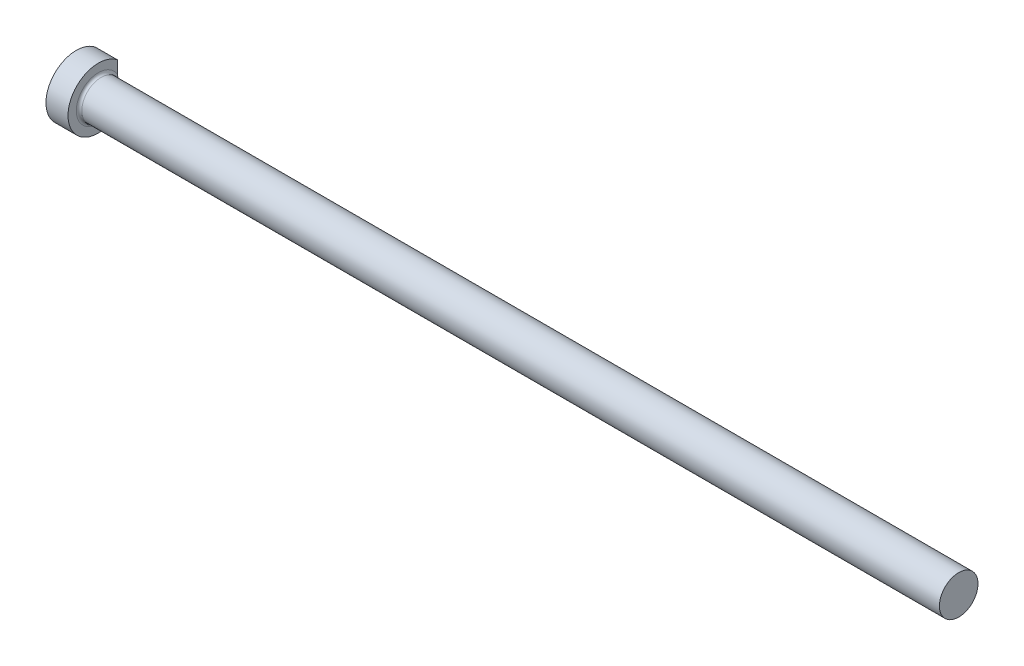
from build123d import *


with BuildPart() as part:
    # Sketch1 → PIN (revolve)
    with BuildSketch(Plane.XY, mode=Mode.PRIVATE) as pin_sk:
        with BuildLine():
            Line((0, 0), (0, 8.73125))
            Line((0, 8.73125), (6.35, 8.73125))
            Line((6.35, 8.73125), (6.35, 6.34365))
            ThreePointArc((6.35, 6.34365), (6.58062412, 5.78687412), (7.1374, 5.55625))
            Line((7.1374, 5.55625), (254, 5.55625))
            Line((254, 5.55625), (254, 0))
            Line((254, 0), (0, 0))
        make_face()
    revolve(pin_sk.sketch.rotate(Axis((254, 0, 0), (-1, 0, 0)), 180), axis=Axis((254, 0, 0), (-1, 0, 0)))

    # SurfaceCut1
    split(bisect_by=Plane(origin=(0, 0, -5.556504), x_dir=(-1, 0, 0), z_dir=(0, 0, -1)), keep=Keep.BOTTOM)


solid = part.part
